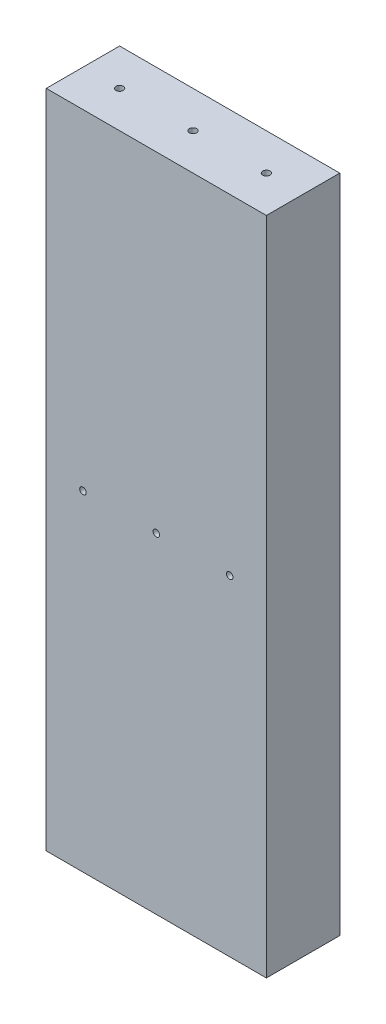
from build123d import *

# Parameters (mm, degrees)
SKETCH1_W                                         = 152.4
SKETCH1_H                                         = 50.8
BOSS_EXTRUDE1_DEPTH                               = 457.2
CSK_FOR_8_FLAT_HEAD_MACHINE_SCREW_100_D           = 4.4958
CSK_FOR_8_FLAT_HEAD_MACHINE_SCREW_100_CSINK_D     = 8.4328
CSK_FOR_8_FLAT_HEAD_MACHINE_SCREW_100_CSINK_ANGLE = 100
F_8_0_199_DIAMETER_HOLE1_D                        = 5.0546
F_8_0_199_DIAMETER_HOLE1_DEPTH                    = 25.4
F_8_0_199_DIAMETER_HOLE1_TIP                      = 1.518555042
F_8_0_199_DIAMETER_HOLE2_D                        = 5.0546
F_8_0_199_DIAMETER_HOLE2_DEPTH                    = 25.4
F_8_0_199_DIAMETER_HOLE2_TIP                      = 1.518555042


with BuildPart() as part:
    # Sketch1 → Boss-Extrude1 (new body)
    with BuildSketch(Plane(origin=(0, 0, 0), x_dir=(1, 0, 0), z_dir=(0, 1, 0))):
        Rectangle(SKETCH1_W, SKETCH1_H)
    extrude(amount=BOSS_EXTRUDE1_DEPTH)

    # CSK for _8 Flat Head Machine Screw _100 (through all)
    with Locations(Plane(origin=(0, 0, -25.4), x_dir=(-1, 0, 0), z_dir=(0, 0, -1))):
        with Locations((50.8, 228.6), (0, 228.6), (-50.8, 228.6)):
            CounterSinkHole(CSK_FOR_8_FLAT_HEAD_MACHINE_SCREW_100_D / 2, CSK_FOR_8_FLAT_HEAD_MACHINE_SCREW_100_CSINK_D / 2, counter_sink_angle=CSK_FOR_8_FLAT_HEAD_MACHINE_SCREW_100_CSINK_ANGLE)

    # 8 _0.199_ Diameter Hole1
    with Locations(Plane(origin=(0, 0, 0), x_dir=(-1, 0, 0), z_dir=(0, -1, 0))):
        with Locations((-50.8, 0), (0, 0), (50.8, 0)):
            Hole(F_8_0_199_DIAMETER_HOLE1_D / 2, depth=F_8_0_199_DIAMETER_HOLE1_DEPTH)
            with Locations((0, 0, -(F_8_0_199_DIAMETER_HOLE1_DEPTH + F_8_0_199_DIAMETER_HOLE1_TIP / 2))):  # 118° drill point
                Cone(0, F_8_0_199_DIAMETER_HOLE1_D / 2, F_8_0_199_DIAMETER_HOLE1_TIP, mode=Mode.SUBTRACT)

    # 8 _0.199_ Diameter Hole2
    with Locations(Plane(origin=(0, 457.2, 0), x_dir=(1, 0, 0), z_dir=(0, 1, 0))):
        with Locations((-50.8, 0), (0, 0), (50.8, 0)):
            Hole(F_8_0_199_DIAMETER_HOLE2_D / 2, depth=F_8_0_199_DIAMETER_HOLE2_DEPTH)
            with Locations((0, 0, -(F_8_0_199_DIAMETER_HOLE2_DEPTH + F_8_0_199_DIAMETER_HOLE2_TIP / 2))):  # 118° drill point
                Cone(0, F_8_0_199_DIAMETER_HOLE2_D / 2, F_8_0_199_DIAMETER_HOLE2_TIP, mode=Mode.SUBTRACT)


solid = part.part
